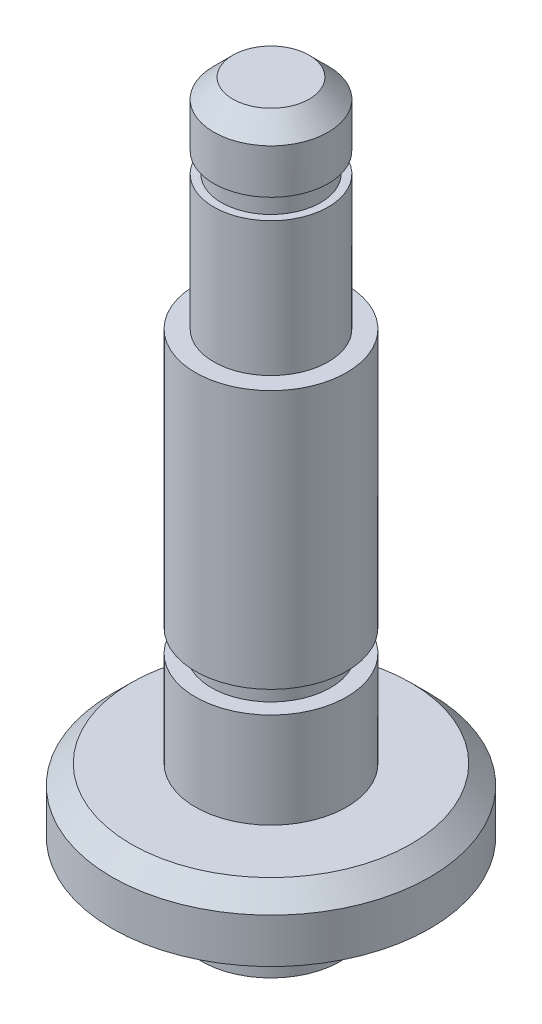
from build123d import *

# Parameters (mm, degrees)
CHAMFER2_SIZE = 0.762
SKETCH3_W     = 0.64135
SKETCH3_H     = 0.889
CHAMFER3_SIZE = 0.762
SKETCH4_W     = 0.3048
SKETCH4_H     = 0.809869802


with BuildPart() as part:
    # Sketch2 → Revolve1 (revolve)
    with BuildSketch(Plane(origin=(0, 0, 0), x_dir=(0, 0, -1), z_dir=(1, 0, 0))):
        Polygon((2.778125, 0), (6.35, 0), (6.35, 2.54), (3.0226, 2.54), (3.0226, 17.5768), (2.286, 17.5768), (2.286, 26.289), (0, 26.289), (0, -2.921), (2.778125, -2.921), align=None)
    revolve(axis=Axis((0, 0, 0), (0, 1, 0)))

    # Chamfer2
    chamfer2_edges = [part.edges().sort_by_distance(p)[0] for p in [
        (0, 2.54, 6.35),
    ]]
    chamfer(chamfer2_edges, length=CHAMFER2_SIZE)

    # Sketch3 → Cut-Revolve1 (revolve, cut)
    with BuildSketch(Plane(origin=(0, 0, 0), x_dir=(0, 0, -1), z_dir=(1, 0, 0))):
        with Locations((2.701925, 6.7945)):
            Rectangle(SKETCH3_W, SKETCH3_H)
    revolve(axis=Axis((0, 0, 0), (0, 1, 0)), mode=Mode.SUBTRACT)

    # Chamfer3
    chamfer3_edges = [part.edges().sort_by_distance(p)[0] for p in [
        (0, 26.289, 2.286),
    ]]
    chamfer(chamfer3_edges, length=CHAMFER3_SIZE)

    # Sketch4 → Cut-Revolve2 (revolve, cut)
    with BuildSketch(Plane(origin=(0, 0, 0), x_dir=(0, 0, -1), z_dir=(1, 0, 0))):
        with Locations((2.1336, 23.341134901)):
            Rectangle(SKETCH4_W, SKETCH4_H)
    revolve(axis=Axis((0, 0, 0), (0, 1, 0)), mode=Mode.SUBTRACT)


solid = part.part
